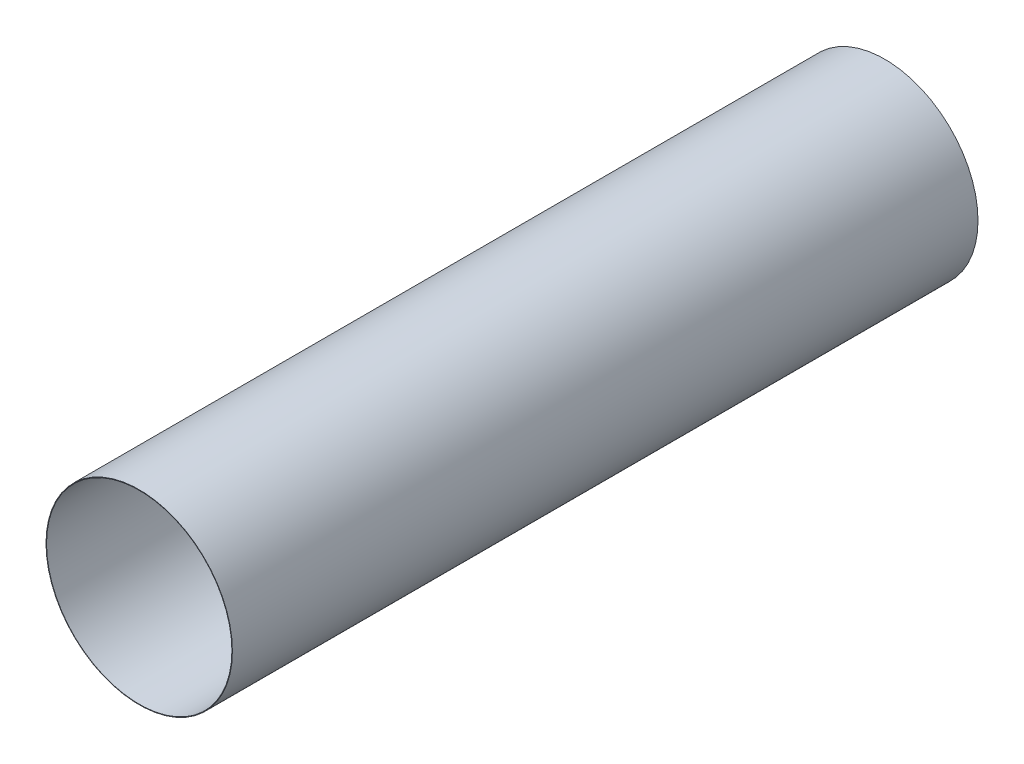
ISO-10303-21;
HEADER;
FILE_DESCRIPTION(('STEP AP214'),'2;1');
FILE_NAME('part.step','',(''),(''),'','','');
FILE_SCHEMA(('AUTOMOTIVE_DESIGN { 1 0 10303 214 1 1 1 1 }'));
ENDSEC;
DATA;
#1=APPLICATION_CONTEXT('core data for automotive mechanical design processes');
#2=APPLICATION_PROTOCOL_DEFINITION('international standard','automotive_design',2000,#1);
#3=PRODUCT_CONTEXT('',#1,'mechanical');
#4=PRODUCT('Part','Part','',(#3));
#5=PRODUCT_RELATED_PRODUCT_CATEGORY('part','',(#4));
#6=PRODUCT_DEFINITION_FORMATION('','',#4);
#7=PRODUCT_DEFINITION_CONTEXT('part definition',#1,'design');
#8=PRODUCT_DEFINITION('design','',#6,#7);
#9=PRODUCT_DEFINITION_SHAPE('','',#8);
#10=(LENGTH_UNIT() NAMED_UNIT(*) SI_UNIT(.MILLI.,.METRE.));
#11=(NAMED_UNIT(*) PLANE_ANGLE_UNIT() SI_UNIT($,.RADIAN.));
#12=(NAMED_UNIT(*) SI_UNIT($,.STERADIAN.) SOLID_ANGLE_UNIT());
#13=UNCERTAINTY_MEASURE_WITH_UNIT(LENGTH_MEASURE(1.E-05),#10,'distance_accuracy_value','');
#14=(GEOMETRIC_REPRESENTATION_CONTEXT(3) GLOBAL_UNCERTAINTY_ASSIGNED_CONTEXT((#13)) GLOBAL_UNIT_ASSIGNED_CONTEXT((#10,
#11,#12)) REPRESENTATION_CONTEXT('',''));
#15=CARTESIAN_POINT('',(0.,0.,0.));
#16=DIRECTION('',(0.,0.,1.));
#17=DIRECTION('',(1.,0.,0.));
#18=AXIS2_PLACEMENT_3D('',#15,#16,#17);
#19=CARTESIAN_POINT('',(0.,0.,3000.));
#20=DIRECTION('',(0.,0.,1.));
#21=DIRECTION('',(1.,0.,0.));
#22=AXIS2_PLACEMENT_3D('',#19,#20,#21);
#23=PLANE('',#22);
#24=CARTESIAN_POINT('',(0.,0.,3000.));
#25=DIRECTION('',(0.,0.,1.));
#26=DIRECTION('',(1.,0.,0.));
#27=AXIS2_PLACEMENT_3D('',#24,#25,#26);
#28=CIRCLE('',#27,375.);
#29=CARTESIAN_POINT('',(375.,0.,3000.));
#30=VERTEX_POINT('',#29);
#31=EDGE_CURVE('E11',#30,#30,#28,.T.);
#32=ORIENTED_EDGE('',*,*,#31,.T.);
#33=EDGE_LOOP('',(#32));
#34=FACE_BOUND('',#33,.T.);
#35=CARTESIAN_POINT('',(0.,0.,3000.));
#36=DIRECTION('',(0.,0.,1.));
#37=DIRECTION('',(1.,0.,0.));
#38=AXIS2_PLACEMENT_3D('',#35,#36,#37);
#39=CIRCLE('',#38,373.);
#40=CARTESIAN_POINT('',(373.,0.,3000.));
#41=VERTEX_POINT('',#40);
#42=EDGE_CURVE('E47',#41,#41,#39,.T.);
#43=ORIENTED_EDGE('',*,*,#42,.F.);
#44=EDGE_LOOP('',(#43));
#45=FACE_BOUND('',#44,.T.);
#46=ADVANCED_FACE('F36',(#34,#45),#23,.T.);
#47=CARTESIAN_POINT('',(0.,0.,0.));
#48=DIRECTION('',(0.,0.,1.));
#49=DIRECTION('',(1.,0.,0.));
#50=AXIS2_PLACEMENT_3D('',#47,#48,#49);
#51=PLANE('',#50);
#52=CARTESIAN_POINT('',(0.,0.,0.));
#53=DIRECTION('',(0.,0.,1.));
#54=DIRECTION('',(1.,0.,0.));
#55=AXIS2_PLACEMENT_3D('',#52,#53,#54);
#56=CIRCLE('',#55,375.);
#57=CARTESIAN_POINT('',(375.,0.,0.));
#58=VERTEX_POINT('',#57);
#59=EDGE_CURVE('E40',#58,#58,#56,.T.);
#60=ORIENTED_EDGE('',*,*,#59,.F.);
#61=EDGE_LOOP('',(#60));
#62=FACE_BOUND('',#61,.T.);
#63=CARTESIAN_POINT('',(0.,0.,0.));
#64=DIRECTION('',(0.,0.,1.));
#65=DIRECTION('',(1.,0.,0.));
#66=AXIS2_PLACEMENT_3D('',#63,#64,#65);
#67=CIRCLE('',#66,373.);
#68=CARTESIAN_POINT('',(373.,0.,0.));
#69=VERTEX_POINT('',#68);
#70=EDGE_CURVE('E49',#69,#69,#67,.T.);
#71=ORIENTED_EDGE('',*,*,#70,.T.);
#72=EDGE_LOOP('',(#71));
#73=FACE_BOUND('',#72,.T.);
#74=ADVANCED_FACE('F59',(#62,#73),#51,.F.);
#75=CARTESIAN_POINT('',(0.,0.,3000.));
#76=DIRECTION('',(0.,0.,-1.));
#77=DIRECTION('',(-1.,0.,0.));
#78=AXIS2_PLACEMENT_3D('',#75,#76,#77);
#79=CYLINDRICAL_SURFACE('',#78,375.);
#80=ORIENTED_EDGE('',*,*,#31,.F.);
#81=EDGE_LOOP('',(#80));
#82=FACE_BOUND('',#81,.T.);
#83=ORIENTED_EDGE('',*,*,#59,.T.);
#84=EDGE_LOOP('',(#83));
#85=FACE_BOUND('',#84,.T.);
#86=ADVANCED_FACE('F38',(#82,#85),#79,.T.);
#87=CARTESIAN_POINT('',(0.,0.,3000.));
#88=DIRECTION('',(0.,0.,-1.));
#89=DIRECTION('',(-1.,0.,0.));
#90=AXIS2_PLACEMENT_3D('',#87,#88,#89);
#91=CYLINDRICAL_SURFACE('',#90,373.);
#92=ORIENTED_EDGE('',*,*,#42,.T.);
#93=EDGE_LOOP('',(#92));
#94=FACE_BOUND('',#93,.T.);
#95=ORIENTED_EDGE('',*,*,#70,.F.);
#96=EDGE_LOOP('',(#95));
#97=FACE_BOUND('',#96,.T.);
#98=ADVANCED_FACE('F55',(#94,#97),#91,.F.);
#99=CLOSED_SHELL('',(#46,#74,#86,#98));
#100=MANIFOLD_SOLID_BREP('B2',#99);
#101=ADVANCED_BREP_SHAPE_REPRESENTATION('',(#18,#100),#14);
#102=SHAPE_DEFINITION_REPRESENTATION(#9,#101);
ENDSEC;
END-ISO-10303-21;
